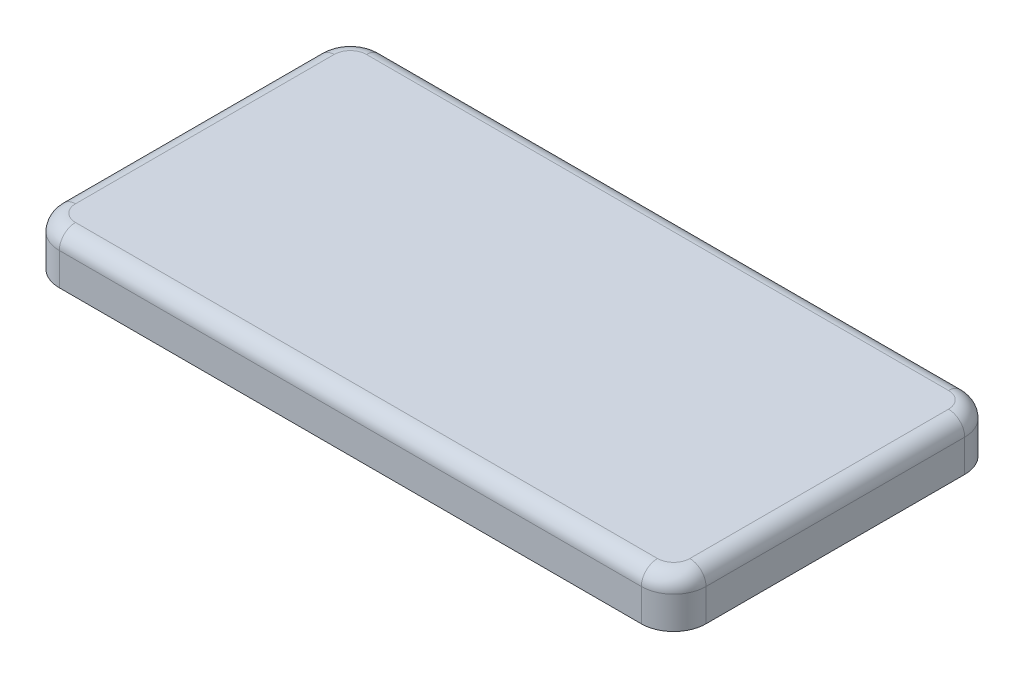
from build123d import *

# Parameters (mm, degrees)
EXTRUDE_1_DEPTH           = 1.5
FILLET_1_R                = 1
CUT_EXTRUDE_2_DEPTH       = 1
SKETCH_4_W                = 4.3
SKETCH_4_H                = 2.6
EXTRUDE_4_DEPTH           = 7
EXTRUDE_4_DRAFT           = 0.5
EXTRUDE_4_PROFILE_2_DEPTH = 7
EXTRUDE_4_PROFILE_2_DRAFT = 0.5
FILLET_2_R                = 1


with BuildPart() as part:
    # Sketch 1 → Extrude 1 (new, symmetric)
    with BuildSketch(Plane(origin=(0, 0, 0), x_dir=(0, 0, -1), z_dir=(0, 1, 0))):
        with BuildLine():
            Line((-8, 20), (8, 20))
            ThreePointArc((8, 20), (9.414213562, 19.414213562), (10, 18))
            Line((10, 18), (10, -18))
            ThreePointArc((10, -18), (9.414213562, -19.414213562), (8, -20))
            Line((8, -20), (-8, -20))
            ThreePointArc((-8, -20), (-9.414213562, -19.414213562), (-10, -18))
            Line((-10, -18), (-10, 18))
            ThreePointArc((-10, 18), (-9.414213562, 19.414213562), (-8, 20))
        make_face()
    extrude(amount=EXTRUDE_1_DEPTH, both=True)

    # Fillet 1
    fillet_1_edges = [part.edges().sort_by_distance(p)[0] for p in [
        (-19.414213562, 1.5, 9.414213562),
        (0, 1.5, 10),
        (19.414213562, 1.5, 9.414213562),
        (20, 1.5, 0),
        (19.414213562, 1.5, -9.414213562),
        (0, 1.5, -10),
        (-19.414213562, 1.5, -9.414213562),
        (-20, 1.5, 0),
    ]]
    fillet(fillet_1_edges, radius=FILLET_1_R)

    # Sketch 2 → Cut-Extrude 2 (cut)
    with BuildSketch(Plane.XZ.offset(1.5)):
        with BuildLine():
            Line((-18, 8.8), (18, 8.8))
            ThreePointArc((18, 8.8), (18.565685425, 8.565685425), (18.8, 8))
            Line((18.8, 8), (18.8, -8))
            ThreePointArc((18.8, -8), (18.565685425, -8.565685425), (18, -8.8))
            Line((18, -8.8), (-18, -8.8))
            ThreePointArc((-18, -8.8), (-18.565685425, -8.565685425), (-18.8, -8))
            Line((-18.8, -8), (-18.8, 8))
            ThreePointArc((-18.8, 8), (-18.565685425, 8.565685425), (-18, 8.8))
        make_face()
    extrude(amount=-CUT_EXTRUDE_2_DEPTH, mode=Mode.SUBTRACT)


with BuildPart() as extrude_4_tool:
    # Sketch 4 → Extrude 4 (with draft: the straight prism first)
    with BuildSketch(Plane.XZ.offset(0.5)):
        with Locations((-10, 0)):
            Rectangle(SKETCH_4_W, SKETCH_4_H)
    extrude(amount=EXTRUDE_4_DEPTH)
    # Extrude 4: the draft: its side faces are tilted about the plane it starts from
    extrude_4_sides = [extrude_4_tool.faces().sort_by_distance(p)[0] for p in [
        (-12.15, -4, 0),
        (-10, -4, -1.3),
        (-7.85, -4, 0),
        (-10, -4, 1.3),
    ]]
    draft(extrude_4_sides, Plane.XZ.offset(0.5), EXTRUDE_4_DRAFT)


with BuildPart() as part_1:
    add(part.part)

    # Extrude 4: add extrude_4_tool
    add(extrude_4_tool.part)


with BuildPart() as extrude_4_profile_2_tool:
    # Sketch 4 → Extrude 4 profile 2 (with draft: the straight prism first)
    with BuildSketch(Plane.XZ.offset(0.5)):
        with Locations((10, 0)):
            Rectangle(SKETCH_4_W, SKETCH_4_H)
    extrude(amount=EXTRUDE_4_PROFILE_2_DEPTH)
    # Extrude 4 profile 2: the draft: its side faces are tilted about the plane it starts from
    extrude_4_profile_2_sides = [extrude_4_profile_2_tool.faces().sort_by_distance(p)[0] for p in [
        (7.85, -4, 0),
        (10, -4, -1.3),
        (12.15, -4, 0),
        (10, -4, 1.3),
    ]]
    draft(extrude_4_profile_2_sides, Plane.XZ.offset(0.5), EXTRUDE_4_PROFILE_2_DRAFT)


with BuildPart() as part_2:
    add(part_1.part)

    # Extrude 4 profile 2: add extrude_4_profile_2_tool
    add(extrude_4_profile_2_tool.part)

    # Fillet 2
    fillet_2_edges = [part_2.edges().sort_by_distance(p)[0] for p in [
        (-12.088911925, -7.5, 0),
        (-10, -7.5, -1.238911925),
        (-7.911088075, -7.5, 0),
        (-10, -7.5, 1.238911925),
        (7.911088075, -7.5, 0),
        (10, -7.5, -1.238911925),
        (12.088911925, -7.5, 0),
        (10, -7.5, 1.238911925),
    ]]
    fillet(fillet_2_edges, radius=FILLET_2_R)


solid = part_2.part
